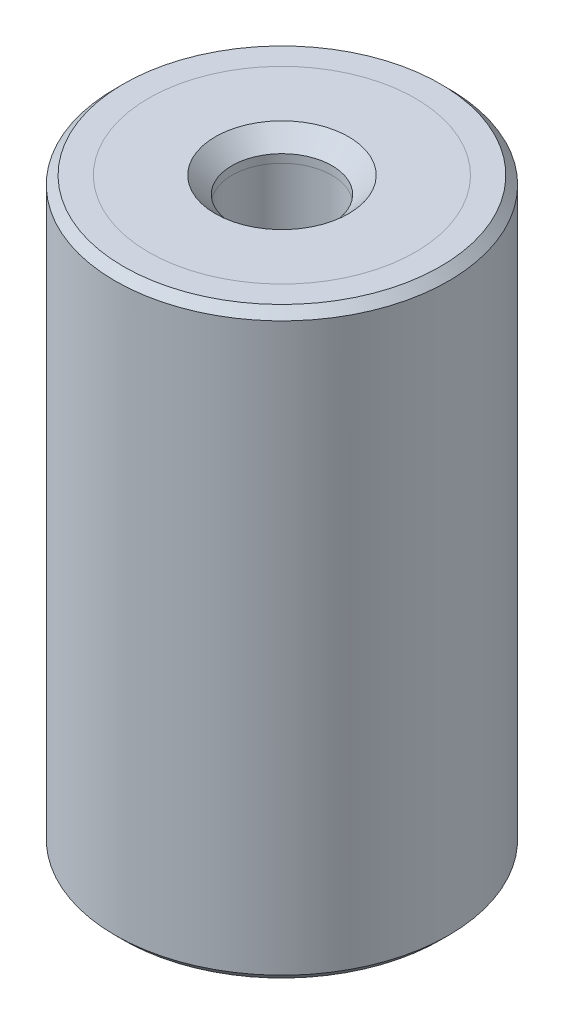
ISO-10303-21;
HEADER;
FILE_DESCRIPTION(('STEP AP214'),'2;1');
FILE_NAME('part.step','',(''),(''),'','','');
FILE_SCHEMA(('AUTOMOTIVE_DESIGN { 1 0 10303 214 1 1 1 1 }'));
ENDSEC;
DATA;
#1=APPLICATION_CONTEXT('core data for automotive mechanical design processes');
#2=APPLICATION_PROTOCOL_DEFINITION('international standard','automotive_design',2000,#1);
#3=PRODUCT_CONTEXT('',#1,'mechanical');
#4=PRODUCT('Part','Part','',(#3));
#5=PRODUCT_RELATED_PRODUCT_CATEGORY('part','',(#4));
#6=PRODUCT_DEFINITION_FORMATION('','',#4);
#7=PRODUCT_DEFINITION_CONTEXT('part definition',#1,'design');
#8=PRODUCT_DEFINITION('design','',#6,#7);
#9=PRODUCT_DEFINITION_SHAPE('','',#8);
#10=(LENGTH_UNIT() NAMED_UNIT(*) SI_UNIT(.MILLI.,.METRE.));
#11=(NAMED_UNIT(*) PLANE_ANGLE_UNIT() SI_UNIT($,.RADIAN.));
#12=(NAMED_UNIT(*) SI_UNIT($,.STERADIAN.) SOLID_ANGLE_UNIT());
#13=UNCERTAINTY_MEASURE_WITH_UNIT(LENGTH_MEASURE(1.E-05),#10,'distance_accuracy_value','');
#14=(GEOMETRIC_REPRESENTATION_CONTEXT(3) GLOBAL_UNCERTAINTY_ASSIGNED_CONTEXT((#13)) GLOBAL_UNIT_ASSIGNED_CONTEXT((#10,
#11,#12)) REPRESENTATION_CONTEXT('',''));
#15=CARTESIAN_POINT('',(0.,0.,0.));
#16=DIRECTION('',(0.,0.,1.));
#17=DIRECTION('',(1.,0.,0.));
#18=AXIS2_PLACEMENT_3D('',#15,#16,#17);
#19=CARTESIAN_POINT('',(0.,36.0340428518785,0.));
#20=DIRECTION('',(0.,1.,0.));
#21=DIRECTION('',(0.,0.,1.));
#22=AXIS2_PLACEMENT_3D('',#19,#20,#21);
#23=CYLINDRICAL_SURFACE('',#22,3.);
#24=CARTESIAN_POINT('',(0.,-32.5,0.));
#25=DIRECTION('',(0.,-1.,0.));
#26=DIRECTION('',(0.,0.,-1.));
#27=AXIS2_PLACEMENT_3D('',#24,#25,#26);
#28=CIRCLE('',#27,3.);
#29=CARTESIAN_POINT('',(0.,-32.5,-3.));
#30=VERTEX_POINT('',#29);
#31=EDGE_CURVE('P0_E10',#30,#30,#28,.T.);
#32=ORIENTED_EDGE('',*,*,#31,.T.);
#33=EDGE_LOOP('',(#32));
#34=FACE_BOUND('',#33,.T.);
#35=CARTESIAN_POINT('',(0.,-32.,0.));
#36=DIRECTION('',(0.,1.,0.));
#37=DIRECTION('',(0.,0.,1.));
#38=AXIS2_PLACEMENT_3D('',#35,#36,#37);
#39=CIRCLE('',#38,3.);
#40=CARTESIAN_POINT('',(0.,-32.,3.));
#41=VERTEX_POINT('',#40);
#42=EDGE_CURVE('P0_E25',#41,#41,#39,.T.);
#43=ORIENTED_EDGE('',*,*,#42,.T.);
#44=EDGE_LOOP('',(#43));
#45=FACE_BOUND('',#44,.T.);
#46=ADVANCED_FACE('P0_F14',(#34,#45),#23,.F.);
#47=CARTESIAN_POINT('',(0.,-32.,3.));
#48=DIRECTION('',(0.,1.,0.));
#49=DIRECTION('',(0.,0.,1.));
#50=AXIS2_PLACEMENT_3D('',#47,#48,#49);
#51=PLANE('',#50);
#52=CARTESIAN_POINT('',(0.,-32.,0.));
#53=DIRECTION('',(0.,1.,0.));
#54=DIRECTION('',(0.,0.,1.));
#55=AXIS2_PLACEMENT_3D('',#52,#53,#54);
#56=CIRCLE('',#55,8.);
#57=CARTESIAN_POINT('',(0.,-32.,8.));
#58=VERTEX_POINT('',#57);
#59=EDGE_CURVE('P0_E29',#58,#58,#56,.T.);
#60=ORIENTED_EDGE('',*,*,#59,.T.);
#61=EDGE_LOOP('',(#60));
#62=FACE_BOUND('',#61,.T.);
#63=ORIENTED_EDGE('',*,*,#42,.F.);
#64=EDGE_LOOP('',(#63));
#65=FACE_BOUND('',#64,.T.);
#66=ADVANCED_FACE('P0_F50',(#62,#65),#51,.T.);
#67=CARTESIAN_POINT('',(0.,36.0340428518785,0.));
#68=DIRECTION('',(0.,1.,0.));
#69=DIRECTION('',(0.,0.,1.));
#70=AXIS2_PLACEMENT_3D('',#67,#68,#69);
#71=CYLINDRICAL_SURFACE('',#70,8.);
#72=CARTESIAN_POINT('',(0.,-33.5,0.));
#73=DIRECTION('',(0.,1.,0.));
#74=DIRECTION('',(0.,0.,1.));
#75=AXIS2_PLACEMENT_3D('',#72,#73,#74);
#76=CIRCLE('',#75,8.);
#77=CARTESIAN_POINT('',(0.,-33.5,8.));
#78=VERTEX_POINT('',#77);
#79=EDGE_CURVE('P0_E34',#78,#78,#76,.T.);
#80=ORIENTED_EDGE('',*,*,#79,.T.);
#81=EDGE_LOOP('',(#80));
#82=FACE_BOUND('',#81,.T.);
#83=ORIENTED_EDGE('',*,*,#59,.F.);
#84=EDGE_LOOP('',(#83));
#85=FACE_BOUND('',#84,.T.);
#86=ADVANCED_FACE('P0_F38',(#82,#85),#71,.T.);
#87=CARTESIAN_POINT('',(0.,-33.5,8.));
#88=DIRECTION('',(0.,-1.,0.));
#89=DIRECTION('',(0.,0.,-1.));
#90=AXIS2_PLACEMENT_3D('',#87,#88,#89);
#91=PLANE('',#90);
#92=CARTESIAN_POINT('',(0.,-33.5,0.));
#93=DIRECTION('',(0.,-1.,0.));
#94=DIRECTION('',(0.,0.,-1.));
#95=AXIS2_PLACEMENT_3D('',#92,#93,#94);
#96=CIRCLE('',#95,4.);
#97=CARTESIAN_POINT('',(0.,-33.5,-4.));
#98=VERTEX_POINT('',#97);
#99=EDGE_CURVE('P0_E21',#98,#98,#96,.F.);
#100=ORIENTED_EDGE('',*,*,#99,.T.);
#101=EDGE_LOOP('',(#100));
#102=FACE_BOUND('',#101,.T.);
#103=ORIENTED_EDGE('',*,*,#79,.F.);
#104=EDGE_LOOP('',(#103));
#105=FACE_BOUND('',#104,.T.);
#106=ADVANCED_FACE('P0_F41',(#102,#105),#91,.T.);
#107=CARTESIAN_POINT('',(0.,-33.5,0.));
#108=DIRECTION('',(0.,-1.,0.));
#109=DIRECTION('',(0.,0.,-1.));
#110=AXIS2_PLACEMENT_3D('',#107,#108,#109);
#111=CONICAL_SURFACE('',#110,4.,0.785398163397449);
#112=ORIENTED_EDGE('',*,*,#31,.F.);
#113=EDGE_LOOP('',(#112));
#114=FACE_BOUND('',#113,.T.);
#115=ORIENTED_EDGE('',*,*,#99,.F.);
#116=EDGE_LOOP('',(#115));
#117=FACE_BOUND('',#116,.T.);
#118=ADVANCED_FACE('P0_F16',(#114,#117),#111,.F.);
#119=CLOSED_SHELL('',(#46,#66,#86,#106,#118));
#120=MANIFOLD_SOLID_BREP('P0_B1',#119);
#121=CARTESIAN_POINT('',(0.,69.5340428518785,0.));
#122=DIRECTION('',(0.,1.,0.));
#123=DIRECTION('',(0.,0.,1.));
#124=AXIS2_PLACEMENT_3D('',#121,#122,#123);
#125=CYLINDRICAL_SURFACE('',#124,3.);
#126=CARTESIAN_POINT('',(0.,0.5,0.));
#127=DIRECTION('',(0.,1.,0.));
#128=DIRECTION('',(0.,0.,1.));
#129=AXIS2_PLACEMENT_3D('',#126,#127,#128);
#130=CIRCLE('',#129,3.);
#131=CARTESIAN_POINT('',(0.,0.5,3.));
#132=VERTEX_POINT('',#131);
#133=EDGE_CURVE('P1_E21',#132,#132,#130,.T.);
#134=ORIENTED_EDGE('',*,*,#133,.T.);
#135=EDGE_LOOP('',(#134));
#136=FACE_BOUND('',#135,.T.);
#137=CARTESIAN_POINT('',(0.,0.,0.));
#138=DIRECTION('',(0.,1.,0.));
#139=DIRECTION('',(0.,0.,1.));
#140=AXIS2_PLACEMENT_3D('',#137,#138,#139);
#141=CIRCLE('',#140,3.);
#142=CARTESIAN_POINT('',(0.,0.,3.));
#143=VERTEX_POINT('',#142);
#144=EDGE_CURVE('P1_E34',#143,#143,#141,.T.);
#145=ORIENTED_EDGE('',*,*,#144,.F.);
#146=EDGE_LOOP('',(#145));
#147=FACE_BOUND('',#146,.T.);
#148=ADVANCED_FACE('P1_F14',(#136,#147),#125,.F.);
#149=CARTESIAN_POINT('',(0.,1.5,3.));
#150=DIRECTION('',(0.,1.,0.));
#151=DIRECTION('',(0.,0.,1.));
#152=AXIS2_PLACEMENT_3D('',#149,#150,#151);
#153=PLANE('',#152);
#154=CARTESIAN_POINT('',(0.,1.5,0.));
#155=DIRECTION('',(0.,1.,0.));
#156=DIRECTION('',(0.,0.,1.));
#157=AXIS2_PLACEMENT_3D('',#154,#155,#156);
#158=CIRCLE('',#157,4.);
#159=CARTESIAN_POINT('',(0.,1.5,4.));
#160=VERTEX_POINT('',#159);
#161=EDGE_CURVE('P1_E10',#160,#160,#158,.F.);
#162=ORIENTED_EDGE('',*,*,#161,.T.);
#163=EDGE_LOOP('',(#162));
#164=FACE_BOUND('',#163,.T.);
#165=CARTESIAN_POINT('',(0.,1.5,0.));
#166=DIRECTION('',(0.,1.,0.));
#167=DIRECTION('',(0.,0.,1.));
#168=AXIS2_PLACEMENT_3D('',#165,#166,#167);
#169=CIRCLE('',#168,8.);
#170=CARTESIAN_POINT('',(0.,1.5,8.));
#171=VERTEX_POINT('',#170);
#172=EDGE_CURVE('P1_E25',#171,#171,#169,.T.);
#173=ORIENTED_EDGE('',*,*,#172,.T.);
#174=EDGE_LOOP('',(#173));
#175=FACE_BOUND('',#174,.T.);
#176=ADVANCED_FACE('P1_F42',(#164,#175),#153,.T.);
#177=CARTESIAN_POINT('',(0.,69.5340428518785,0.));
#178=DIRECTION('',(0.,1.,0.));
#179=DIRECTION('',(0.,0.,1.));
#180=AXIS2_PLACEMENT_3D('',#177,#178,#179);
#181=CYLINDRICAL_SURFACE('',#180,8.);
#182=CARTESIAN_POINT('',(0.,0.,0.));
#183=DIRECTION('',(0.,1.,0.));
#184=DIRECTION('',(0.,0.,1.));
#185=AXIS2_PLACEMENT_3D('',#182,#183,#184);
#186=CIRCLE('',#185,8.);
#187=CARTESIAN_POINT('',(0.,0.,8.));
#188=VERTEX_POINT('',#187);
#189=EDGE_CURVE('P1_E29',#188,#188,#186,.T.);
#190=ORIENTED_EDGE('',*,*,#189,.T.);
#191=EDGE_LOOP('',(#190));
#192=FACE_BOUND('',#191,.T.);
#193=ORIENTED_EDGE('',*,*,#172,.F.);
#194=EDGE_LOOP('',(#193));
#195=FACE_BOUND('',#194,.T.);
#196=ADVANCED_FACE('P1_F47',(#192,#195),#181,.T.);
#197=CARTESIAN_POINT('',(0.,0.,8.));
#198=DIRECTION('',(0.,-1.,0.));
#199=DIRECTION('',(0.,0.,-1.));
#200=AXIS2_PLACEMENT_3D('',#197,#198,#199);
#201=PLANE('',#200);
#202=ORIENTED_EDGE('',*,*,#144,.T.);
#203=EDGE_LOOP('',(#202));
#204=FACE_BOUND('',#203,.T.);
#205=ORIENTED_EDGE('',*,*,#189,.F.);
#206=EDGE_LOOP('',(#205));
#207=FACE_BOUND('',#206,.T.);
#208=ADVANCED_FACE('P1_F38',(#204,#207),#201,.T.);
#209=CARTESIAN_POINT('',(0.,0.5,0.));
#210=DIRECTION('',(0.,1.,0.));
#211=DIRECTION('',(0.,0.,1.));
#212=AXIS2_PLACEMENT_3D('',#209,#210,#211);
#213=CONICAL_SURFACE('',#212,3.,0.78539816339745);
#214=ORIENTED_EDGE('',*,*,#161,.F.);
#215=EDGE_LOOP('',(#214));
#216=FACE_BOUND('',#215,.T.);
#217=ORIENTED_EDGE('',*,*,#133,.F.);
#218=EDGE_LOOP('',(#217));
#219=FACE_BOUND('',#218,.T.);
#220=ADVANCED_FACE('P1_F16',(#216,#219),#213,.F.);
#221=CLOSED_SHELL('',(#148,#176,#196,#208,#220));
#222=MANIFOLD_SOLID_BREP('P1_B1',#221);
#223=CARTESIAN_POINT('',(0.,0.,0.));
#224=DIRECTION('',(0.,1.,0.));
#225=DIRECTION('',(0.,0.,1.));
#226=AXIS2_PLACEMENT_3D('',#223,#224,#225);
#227=PLANE('',#226);
#228=CARTESIAN_POINT('',(0.,0.,0.));
#229=DIRECTION('',(0.,1.,0.));
#230=DIRECTION('',(0.,0.,1.));
#231=AXIS2_PLACEMENT_3D('',#228,#229,#230);
#232=CIRCLE('',#231,3.);
#233=CARTESIAN_POINT('',(0.,0.,3.));
#234=VERTEX_POINT('',#233);
#235=EDGE_CURVE('P2_E46',#234,#234,#232,.T.);
#236=ORIENTED_EDGE('',*,*,#235,.F.);
#237=EDGE_LOOP('',(#236));
#238=FACE_BOUND('',#237,.T.);
#239=CARTESIAN_POINT('',(0.,0.,0.));
#240=DIRECTION('',(0.,1.,0.));
#241=DIRECTION('',(0.,0.,1.));
#242=AXIS2_PLACEMENT_3D('',#239,#240,#241);
#243=CIRCLE('',#242,8.);
#244=CARTESIAN_POINT('',(0.,0.,8.));
#245=VERTEX_POINT('',#244);
#246=EDGE_CURVE('P2_E33',#245,#245,#243,.T.);
#247=ORIENTED_EDGE('',*,*,#246,.T.);
#248=EDGE_LOOP('',(#247));
#249=FACE_BOUND('',#248,.T.);
#250=ADVANCED_FACE('P2_F13',(#238,#249),#227,.T.);
#251=CARTESIAN_POINT('',(0.,65.5134936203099,0.));
#252=DIRECTION('',(0.,1.,0.));
#253=DIRECTION('',(0.,0.,1.));
#254=AXIS2_PLACEMENT_3D('',#251,#252,#253);
#255=CYLINDRICAL_SURFACE('',#254,8.);
#256=CARTESIAN_POINT('',(0.,1.5,0.));
#257=DIRECTION('',(0.,1.,0.));
#258=DIRECTION('',(0.,0.,1.));
#259=AXIS2_PLACEMENT_3D('',#256,#257,#258);
#260=CIRCLE('',#259,8.);
#261=CARTESIAN_POINT('',(0.,1.5,8.));
#262=VERTEX_POINT('',#261);
#263=EDGE_CURVE('P2_E36',#262,#262,#260,.T.);
#264=ORIENTED_EDGE('',*,*,#263,.T.);
#265=EDGE_LOOP('',(#264));
#266=FACE_BOUND('',#265,.T.);
#267=ORIENTED_EDGE('',*,*,#246,.F.);
#268=EDGE_LOOP('',(#267));
#269=FACE_BOUND('',#268,.T.);
#270=ADVANCED_FACE('P2_F92',(#266,#269),#255,.F.);
#271=CARTESIAN_POINT('',(0.,1.5,8.));
#272=DIRECTION('',(0.,1.,0.));
#273=DIRECTION('',(0.,0.,1.));
#274=AXIS2_PLACEMENT_3D('',#271,#272,#273);
#275=PLANE('',#274);
#276=CARTESIAN_POINT('',(0.,1.5,0.));
#277=DIRECTION('',(0.,1.,0.));
#278=DIRECTION('',(0.,0.,1.));
#279=AXIS2_PLACEMENT_3D('',#276,#277,#278);
#280=CIRCLE('',#279,9.5);
#281=CARTESIAN_POINT('',(0.,1.5,9.5));
#282=VERTEX_POINT('',#281);
#283=EDGE_CURVE('P2_E9',#282,#282,#280,.T.);
#284=ORIENTED_EDGE('',*,*,#283,.T.);
#285=EDGE_LOOP('',(#284));
#286=FACE_BOUND('',#285,.T.);
#287=ORIENTED_EDGE('',*,*,#263,.F.);
#288=EDGE_LOOP('',(#287));
#289=FACE_BOUND('',#288,.T.);
#290=ADVANCED_FACE('P2_F88',(#286,#289),#275,.T.);
#291=CARTESIAN_POINT('',(0.,65.5134936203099,0.));
#292=DIRECTION('',(0.,1.,0.));
#293=DIRECTION('',(0.,0.,1.));
#294=AXIS2_PLACEMENT_3D('',#291,#292,#293);
#295=CYLINDRICAL_SURFACE('',#294,10.);
#296=CARTESIAN_POINT('',(0.,-33.,0.));
#297=DIRECTION('',(0.,-1.,0.));
#298=DIRECTION('',(0.,0.,-1.));
#299=AXIS2_PLACEMENT_3D('',#296,#297,#298);
#300=CIRCLE('',#299,10.);
#301=CARTESIAN_POINT('',(0.,-33.,-10.));
#302=VERTEX_POINT('',#301);
#303=EDGE_CURVE('P2_E24',#302,#302,#300,.F.);
#304=ORIENTED_EDGE('',*,*,#303,.T.);
#305=EDGE_LOOP('',(#304));
#306=FACE_BOUND('',#305,.T.);
#307=CARTESIAN_POINT('',(0.,1.,0.));
#308=DIRECTION('',(0.,1.,0.));
#309=DIRECTION('',(0.,0.,1.));
#310=AXIS2_PLACEMENT_3D('',#307,#308,#309);
#311=CIRCLE('',#310,10.);
#312=CARTESIAN_POINT('',(0.,1.,10.));
#313=VERTEX_POINT('',#312);
#314=EDGE_CURVE('P2_E28',#313,#313,#311,.F.);
#315=ORIENTED_EDGE('',*,*,#314,.T.);
#316=EDGE_LOOP('',(#315));
#317=FACE_BOUND('',#316,.T.);
#318=ADVANCED_FACE('P2_F82',(#306,#317),#295,.T.);
#319=CARTESIAN_POINT('',(0.,-33.5,9.99999999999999));
#320=DIRECTION('',(0.,-1.,0.));
#321=DIRECTION('',(0.,0.,-1.));
#322=AXIS2_PLACEMENT_3D('',#319,#320,#321);
#323=PLANE('',#322);
#324=CARTESIAN_POINT('',(0.,-33.5,0.));
#325=DIRECTION('',(0.,-1.,0.));
#326=DIRECTION('',(0.,0.,-1.));
#327=AXIS2_PLACEMENT_3D('',#324,#325,#326);
#328=CIRCLE('',#327,9.49999999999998);
#329=CARTESIAN_POINT('',(0.,-33.5,-9.49999999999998));
#330=VERTEX_POINT('',#329);
#331=EDGE_CURVE('P2_E20',#330,#330,#328,.T.);
#332=ORIENTED_EDGE('',*,*,#331,.T.);
#333=EDGE_LOOP('',(#332));
#334=FACE_BOUND('',#333,.T.);
#335=CARTESIAN_POINT('',(0.,-33.5,0.));
#336=DIRECTION('',(0.,1.,0.));
#337=DIRECTION('',(0.,0.,1.));
#338=AXIS2_PLACEMENT_3D('',#335,#336,#337);
#339=CIRCLE('',#338,8.);
#340=CARTESIAN_POINT('',(0.,-33.5,8.));
#341=VERTEX_POINT('',#340);
#342=EDGE_CURVE('P2_E39',#341,#341,#339,.T.);
#343=ORIENTED_EDGE('',*,*,#342,.T.);
#344=EDGE_LOOP('',(#343));
#345=FACE_BOUND('',#344,.T.);
#346=ADVANCED_FACE('P2_F77',(#334,#345),#323,.T.);
#347=CARTESIAN_POINT('',(0.,65.5134936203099,0.));
#348=DIRECTION('',(0.,1.,0.));
#349=DIRECTION('',(0.,0.,1.));
#350=AXIS2_PLACEMENT_3D('',#347,#348,#349);
#351=CYLINDRICAL_SURFACE('',#350,8.);
#352=CARTESIAN_POINT('',(0.,-32.,0.));
#353=DIRECTION('',(0.,1.,0.));
#354=DIRECTION('',(0.,0.,1.));
#355=AXIS2_PLACEMENT_3D('',#352,#353,#354);
#356=CIRCLE('',#355,8.);
#357=CARTESIAN_POINT('',(0.,-32.,8.));
#358=VERTEX_POINT('',#357);
#359=EDGE_CURVE('P2_E42',#358,#358,#356,.T.);
#360=ORIENTED_EDGE('',*,*,#359,.T.);
#361=EDGE_LOOP('',(#360));
#362=FACE_BOUND('',#361,.T.);
#363=ORIENTED_EDGE('',*,*,#342,.F.);
#364=EDGE_LOOP('',(#363));
#365=FACE_BOUND('',#364,.T.);
#366=ADVANCED_FACE('P2_F71',(#362,#365),#351,.F.);
#367=CARTESIAN_POINT('',(0.,-32.,8.));
#368=DIRECTION('',(0.,-1.,0.));
#369=DIRECTION('',(0.,0.,-1.));
#370=AXIS2_PLACEMENT_3D('',#367,#368,#369);
#371=PLANE('',#370);
#372=CARTESIAN_POINT('',(0.,-32.,0.));
#373=DIRECTION('',(0.,-1.,0.));
#374=DIRECTION('',(0.,0.,-1.));
#375=AXIS2_PLACEMENT_3D('',#372,#373,#374);
#376=CIRCLE('',#375,3.);
#377=CARTESIAN_POINT('',(0.,-32.,-3.));
#378=VERTEX_POINT('',#377);
#379=EDGE_CURVE('P2_E52',#378,#378,#376,.T.);
#380=ORIENTED_EDGE('',*,*,#379,.F.);
#381=EDGE_LOOP('',(#380));
#382=FACE_BOUND('',#381,.T.);
#383=ORIENTED_EDGE('',*,*,#359,.F.);
#384=EDGE_LOOP('',(#383));
#385=FACE_BOUND('',#384,.T.);
#386=ADVANCED_FACE('P2_F67',(#382,#385),#371,.T.);
#387=CARTESIAN_POINT('',(0.,-33.,0.));
#388=DIRECTION('',(0.,1.,0.));
#389=DIRECTION('',(0.,0.,1.));
#390=AXIS2_PLACEMENT_3D('',#387,#388,#389);
#391=CONICAL_SURFACE('',#390,10.,0.785398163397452);
#392=ORIENTED_EDGE('',*,*,#331,.F.);
#393=EDGE_LOOP('',(#392));
#394=FACE_BOUND('',#393,.T.);
#395=ORIENTED_EDGE('',*,*,#303,.F.);
#396=EDGE_LOOP('',(#395));
#397=FACE_BOUND('',#396,.T.);
#398=ADVANCED_FACE('P2_F70',(#394,#397),#391,.T.);
#399=CARTESIAN_POINT('',(0.,1.5,0.));
#400=DIRECTION('',(0.,-1.,0.));
#401=DIRECTION('',(0.,0.,-1.));
#402=AXIS2_PLACEMENT_3D('',#399,#400,#401);
#403=CONICAL_SURFACE('',#402,9.49999999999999,0.785398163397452);
#404=ORIENTED_EDGE('',*,*,#314,.F.);
#405=EDGE_LOOP('',(#404));
#406=FACE_BOUND('',#405,.T.);
#407=ORIENTED_EDGE('',*,*,#283,.F.);
#408=EDGE_LOOP('',(#407));
#409=FACE_BOUND('',#408,.T.);
#410=ADVANCED_FACE('P2_F15',(#406,#409),#403,.T.);
#411=CARTESIAN_POINT('',(0.,-4.5,0.));
#412=DIRECTION('',(0.,1.,0.));
#413=DIRECTION('',(0.,0.,1.));
#414=AXIS2_PLACEMENT_3D('',#411,#412,#413);
#415=CYLINDRICAL_SURFACE('',#414,3.);
#416=CARTESIAN_POINT('',(0.,-4.5,0.));
#417=DIRECTION('',(0.,1.,0.));
#418=DIRECTION('',(0.,0.,1.));
#419=AXIS2_PLACEMENT_3D('',#416,#417,#418);
#420=CIRCLE('',#419,3.);
#421=CARTESIAN_POINT('',(0.,-4.5,3.));
#422=VERTEX_POINT('',#421);
#423=EDGE_CURVE('P2_E45',#422,#422,#420,.T.);
#424=ORIENTED_EDGE('',*,*,#423,.F.);
#425=EDGE_LOOP('',(#424));
#426=FACE_BOUND('',#425,.T.);
#427=ORIENTED_EDGE('',*,*,#235,.T.);
#428=EDGE_LOOP('',(#427));
#429=FACE_BOUND('',#428,.T.);
#430=ADVANCED_FACE('P2_F108',(#426,#429),#415,.F.);
#431=CARTESIAN_POINT('',(0.,-4.5,0.));
#432=DIRECTION('',(0.,1.,0.));
#433=DIRECTION('',(0.,0.,1.));
#434=AXIS2_PLACEMENT_3D('',#431,#432,#433);
#435=PLANE('',#434);
#436=ORIENTED_EDGE('',*,*,#423,.T.);
#437=EDGE_LOOP('',(#436));
#438=FACE_BOUND('',#437,.T.);
#439=ADVANCED_FACE('P2_F63',(#438),#435,.T.);
#440=CARTESIAN_POINT('',(0.,-27.5,0.));
#441=DIRECTION('',(0.,-1.,0.));
#442=DIRECTION('',(0.,0.,-1.));
#443=AXIS2_PLACEMENT_3D('',#440,#441,#442);
#444=CYLINDRICAL_SURFACE('',#443,3.);
#445=CARTESIAN_POINT('',(0.,-27.5,0.));
#446=DIRECTION('',(0.,-1.,0.));
#447=DIRECTION('',(0.,0.,-1.));
#448=AXIS2_PLACEMENT_3D('',#445,#446,#447);
#449=CIRCLE('',#448,3.);
#450=CARTESIAN_POINT('',(0.,-27.5,-3.));
#451=VERTEX_POINT('',#450);
#452=EDGE_CURVE('P2_E49',#451,#451,#449,.T.);
#453=ORIENTED_EDGE('',*,*,#452,.F.);
#454=EDGE_LOOP('',(#453));
#455=FACE_BOUND('',#454,.T.);
#456=ORIENTED_EDGE('',*,*,#379,.T.);
#457=EDGE_LOOP('',(#456));
#458=FACE_BOUND('',#457,.T.);
#459=ADVANCED_FACE('P2_F60',(#455,#458),#444,.F.);
#460=CARTESIAN_POINT('',(0.,-27.5,0.));
#461=DIRECTION('',(0.,-1.,0.));
#462=DIRECTION('',(0.,0.,-1.));
#463=AXIS2_PLACEMENT_3D('',#460,#461,#462);
#464=PLANE('',#463);
#465=ORIENTED_EDGE('',*,*,#452,.T.);
#466=EDGE_LOOP('',(#465));
#467=FACE_BOUND('',#466,.T.);
#468=ADVANCED_FACE('P2_F58',(#467),#464,.T.);
#469=CLOSED_SHELL('',(#250,#270,#290,#318,#346,#366,#386,#398,#410,#430,#439,#459,#468));
#470=MANIFOLD_SOLID_BREP('P2_B1',#469);
#471=ADVANCED_BREP_SHAPE_REPRESENTATION('',(#18,#120,#222,#470),#14);
#472=SHAPE_DEFINITION_REPRESENTATION(#9,#471);
ENDSEC;
END-ISO-10303-21;
